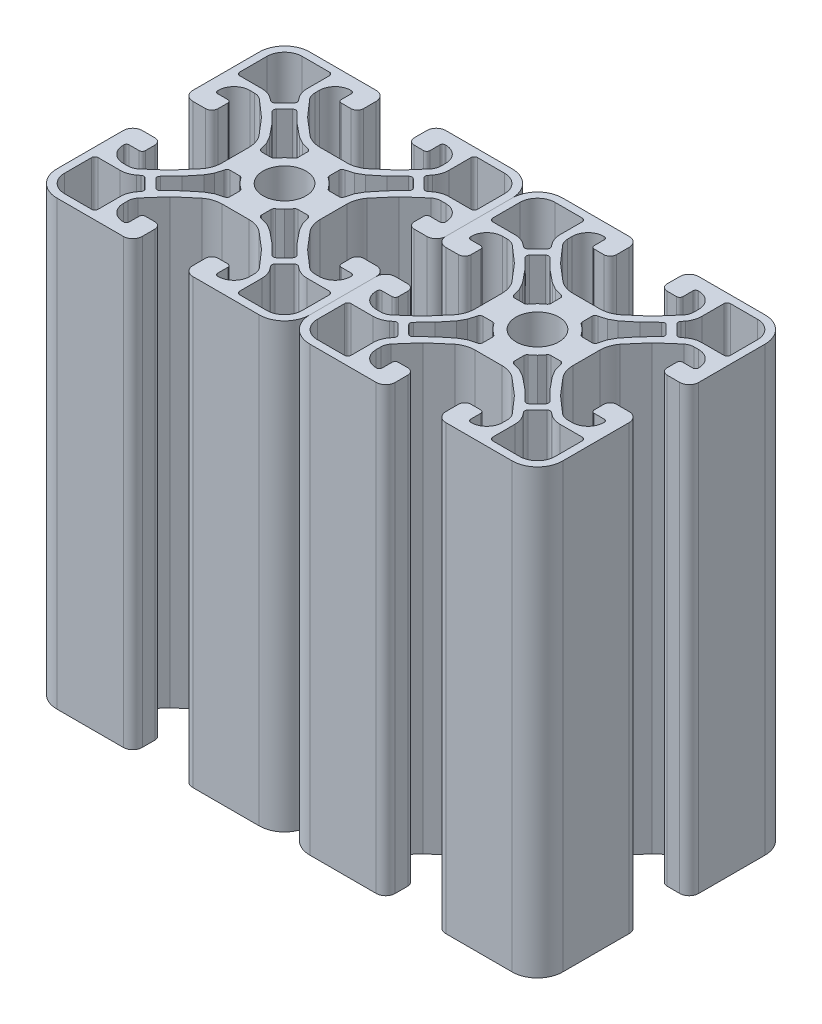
from build123d import *

# Parameters (mm, degrees)
MODEL_R                          = 3.4
PROFILE_10396_PRO4040E_1_DEPTH   = 70
MODEL_ON_SEGMENT_2_R             = 3.4
PROFILE_10396_PRO4040E_1_2_DEPTH = 70


with BuildPart() as part:
    # Model → Profile 10396_PRO4040E_1 (new body)
    with BuildSketch(Plane(origin=(-20, 35, 0), x_dir=(1, 0, 0), z_dir=(0, -1, 0))):
        with BuildLine():
            Line((14.783583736, 10), (15.5, 10))
            ThreePointArc((15.5, 10), (17.267766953, 9.267766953), (18, 7.5))
            Line((18, 7.5), (18, 7.41))
            ThreePointArc((18, 7.41), (17.87991378, 7.12008622), (17.59, 7))
            Line((17.59, 7), (16, 7))
            ThreePointArc((16, 7), (15.646446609, 6.853553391), (15.5, 6.5))
            Line((15.5, 6.5), (15.5, 5))
            ThreePointArc((15.5, 5), (15.792893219, 4.292893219), (16.5, 4))
            Line((16.5, 4), (18.5, 4))
            ThreePointArc((18.5, 4), (19.560660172, 4.439339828), (20, 5.5))
            Line((20, 5.5), (20, 16))
            ThreePointArc((20, 16), (18.828427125, 18.828427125), (16, 20))
            Line((16, 20), (5.5, 20))
            ThreePointArc((5.5, 20), (4.439339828, 19.560660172), (4, 18.5))
            Line((4, 18.5), (4, 16.5))
            ThreePointArc((4, 16.5), (4.292893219, 15.792893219), (5, 15.5))
            Line((5, 15.5), (6.5, 15.5))
            ThreePointArc((6.5, 15.5), (6.853553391, 15.646446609), (7, 16))
            Line((7, 16), (7, 17.59))
            ThreePointArc((7, 17.59), (7.12008622, 17.87991378), (7.41, 18))
            Line((7.41, 18), (7.5, 18))
            ThreePointArc((7.5, 18), (9.267766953, 17.267766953), (10, 15.5))
            Line((10, 15.5), (10, 14.783583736))
            ThreePointArc((10, 14.783583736), (9.896220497, 14.147700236), (9.595652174, 13.577808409))
            Line((9.595652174, 13.577808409), (7.22489987, 10.870154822))
            Line((7.22489987, 10.870154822), (4.489943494, 8.530952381))
            ThreePointArc((4.489943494, 8.530952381), (3.365314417, 7.950250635), (2.115552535, 7.75))
            Line((2.115552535, 7.75), (-2.115552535, 7.75))
            ThreePointArc((-2.115552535, 7.75), (-3.365314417, 7.950250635), (-4.489943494, 8.530952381))
            Line((-4.489943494, 8.530952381), (-7.22489987, 10.870154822))
            Line((-7.22489987, 10.870154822), (-9.595652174, 13.577808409))
            ThreePointArc((-9.595652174, 13.577808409), (-9.896220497, 14.147700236), (-10, 14.783583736))
            Line((-10, 14.783583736), (-10, 15.5))
            ThreePointArc((-10, 15.5), (-9.267766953, 17.267766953), (-7.5, 18))
            Line((-7.5, 18), (-7.41, 18))
            ThreePointArc((-7.41, 18), (-7.12008622, 17.87991378), (-7, 17.59))
            Line((-7, 17.59), (-7, 16))
            ThreePointArc((-7, 16), (-6.853553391, 15.646446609), (-6.5, 15.5))
            Line((-6.5, 15.5), (-5, 15.5))
            ThreePointArc((-5, 15.5), (-4.292893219, 15.792893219), (-4, 16.5))
            Line((-4, 16.5), (-4, 18.5))
            ThreePointArc((-4, 18.5), (-4.439339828, 19.560660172), (-5.5, 20))
            Line((-5.5, 20), (-16, 20))
            ThreePointArc((-16, 20), (-18.828427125, 18.828427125), (-20, 16))
            Line((-20, 16), (-20, 5.5))
            ThreePointArc((-20, 5.5), (-19.560660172, 4.439339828), (-18.5, 4))
            Line((-18.5, 4), (-16.5, 4))
            ThreePointArc((-16.5, 4), (-15.792893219, 4.292893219), (-15.5, 5))
            Line((-15.5, 5), (-15.5, 6.5))
            ThreePointArc((-15.5, 6.5), (-15.646446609, 6.853553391), (-16, 7))
            Line((-16, 7), (-17.59, 7))
            ThreePointArc((-17.59, 7), (-17.87991378, 7.12008622), (-18, 7.41))
            Line((-18, 7.41), (-18, 7.5))
            ThreePointArc((-18, 7.5), (-17.267766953, 9.267766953), (-15.5, 10))
            Line((-15.5, 10), (-14.783583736, 10))
            ThreePointArc((-14.783583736, 10), (-14.147700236, 9.896220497), (-13.577808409, 9.595652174))
            Line((-13.577808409, 9.595652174), (-10.870154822, 7.22489987))
            Line((-10.870154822, 7.22489987), (-8.530952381, 4.489943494))
            ThreePointArc((-8.530952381, 4.489943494), (-7.950250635, 3.365314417), (-7.75, 2.115552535))
            Line((-7.75, 2.115552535), (-7.75, -2.115552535))
            ThreePointArc((-7.75, -2.115552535), (-7.950250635, -3.365314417), (-8.530952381, -4.489943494))
            Line((-8.530952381, -4.489943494), (-10.870154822, -7.22489987))
            Line((-10.870154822, -7.22489987), (-13.577808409, -9.595652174))
            ThreePointArc((-13.577808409, -9.595652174), (-14.147700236, -9.896220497), (-14.783583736, -10))
            Line((-14.783583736, -10), (-15.5, -10))
            ThreePointArc((-15.5, -10), (-17.267766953, -9.267766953), (-18, -7.5))
            Line((-18, -7.5), (-18, -7.41))
            ThreePointArc((-18, -7.41), (-17.87991378, -7.12008622), (-17.59, -7))
            Line((-17.59, -7), (-16, -7))
            ThreePointArc((-16, -7), (-15.646446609, -6.853553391), (-15.5, -6.5))
            Line((-15.5, -6.5), (-15.5, -5))
            ThreePointArc((-15.5, -5), (-15.792893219, -4.292893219), (-16.5, -4))
            Line((-16.5, -4), (-18.5, -4))
            ThreePointArc((-18.5, -4), (-19.560660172, -4.439339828), (-20, -5.5))
            Line((-20, -5.5), (-20, -16))
            ThreePointArc((-20, -16), (-18.828427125, -18.828427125), (-16, -20))
            Line((-16, -20), (-5.5, -20))
            ThreePointArc((-5.5, -20), (-4.439339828, -19.560660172), (-4, -18.5))
            Line((-4, -18.5), (-4, -16.5))
            ThreePointArc((-4, -16.5), (-4.292893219, -15.792893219), (-5, -15.5))
            Line((-5, -15.5), (-6.5, -15.5))
            ThreePointArc((-6.5, -15.5), (-6.853553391, -15.646446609), (-7, -16))
            Line((-7, -16), (-7, -17.59))
            ThreePointArc((-7, -17.59), (-7.12008622, -17.87991378), (-7.41, -18))
            Line((-7.41, -18), (-7.5, -18))
            ThreePointArc((-7.5, -18), (-9.267766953, -17.267766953), (-10, -15.5))
            Line((-10, -15.5), (-10, -14.783583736))
            ThreePointArc((-10, -14.783583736), (-9.896220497, -14.147700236), (-9.595652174, -13.577808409))
            Line((-9.595652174, -13.577808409), (-7.22489987, -10.870154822))
            Line((-7.22489987, -10.870154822), (-4.489943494, -8.530952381))
            ThreePointArc((-4.489943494, -8.530952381), (-3.365314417, -7.950250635), (-2.115552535, -7.75))
            Line((-2.115552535, -7.75), (2.115552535, -7.75))
            ThreePointArc((2.115552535, -7.75), (3.365314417, -7.950250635), (4.489943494, -8.530952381))
            Line((4.489943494, -8.530952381), (7.22489987, -10.870154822))
            Line((7.22489987, -10.870154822), (9.595652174, -13.577808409))
            ThreePointArc((9.595652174, -13.577808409), (9.896220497, -14.147700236), (10, -14.783583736))
            Line((10, -14.783583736), (10, -15.5))
            ThreePointArc((10, -15.5), (9.267766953, -17.267766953), (7.5, -18))
            Line((7.5, -18), (7.41, -18))
            ThreePointArc((7.41, -18), (7.12008622, -17.87991378), (7, -17.59))
            Line((7, -17.59), (7, -16))
            ThreePointArc((7, -16), (6.853553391, -15.646446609), (6.5, -15.5))
            Line((6.5, -15.5), (5, -15.5))
            ThreePointArc((5, -15.5), (4.292893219, -15.792893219), (4, -16.5))
            Line((4, -16.5), (4, -18.5))
            ThreePointArc((4, -18.5), (4.439339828, -19.560660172), (5.5, -20))
            Line((5.5, -20), (16, -20))
            ThreePointArc((16, -20), (18.828427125, -18.828427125), (20, -16))
            Line((20, -16), (20, -5.5))
            ThreePointArc((20, -5.5), (19.560660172, -4.439339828), (18.5, -4))
            Line((18.5, -4), (16.5, -4))
            ThreePointArc((16.5, -4), (15.792893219, -4.292893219), (15.5, -5))
            Line((15.5, -5), (15.5, -6.5))
            ThreePointArc((15.5, -6.5), (15.646446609, -6.853553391), (16, -7))
            Line((16, -7), (17.59, -7))
            ThreePointArc((17.59, -7), (17.87991378, -7.12008622), (18, -7.41))
            Line((18, -7.41), (18, -7.5))
            ThreePointArc((18, -7.5), (17.267766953, -9.267766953), (15.5, -10))
            Line((15.5, -10), (14.783583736, -10))
            ThreePointArc((14.783583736, -10), (14.147700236, -9.896220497), (13.577808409, -9.595652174))
            Line((13.577808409, -9.595652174), (10.870154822, -7.22489987))
            Line((10.870154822, -7.22489987), (8.530952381, -4.489943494))
            ThreePointArc((8.530952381, -4.489943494), (7.950250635, -3.365314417), (7.75, -2.115552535))
            Line((7.75, -2.115552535), (7.75, 2.115552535))
            ThreePointArc((7.75, 2.115552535), (7.950250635, 3.365314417), (8.530952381, 4.489943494))
            Line((8.530952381, 4.489943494), (10.870154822, 7.22489987))
            Line((10.870154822, 7.22489987), (13.577808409, 9.595652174))
            ThreePointArc((13.577808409, 9.595652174), (14.147700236, 9.896220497), (14.783583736, 10))
        make_face()
        Circle(MODEL_R, mode=Mode.SUBTRACT)
        with BuildLine():
            Line((6.119036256, 2.5), (4.609772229, 2.5))
            ThreePointArc((4.609772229, 2.5), (4.371406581, 2.560475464), (4.190702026, 2.727272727))
            Line((4.190702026, 2.727272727), (3.535533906, 3.535533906))
            Line((3.535533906, 3.535533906), (2.727272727, 4.190702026))
            ThreePointArc((2.727272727, 4.190702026), (2.560475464, 4.371406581), (2.5, 4.609772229))
            Line((2.5, 4.609772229), (2.5, 6.119036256))
            ThreePointArc((2.5, 6.119036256), (2.620005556, 6.444004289), (2.922416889, 6.612980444))
            Line((2.922416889, 6.612980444), (4.119717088, 6.951737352))
            Line((4.119717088, 6.951737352), (5.202260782, 7.565238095))
            Line((5.202260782, 7.565238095), (7.09151636, 9.099206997))
            Line((7.09151636, 9.099206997), (8.830293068, 10.801852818))
            ThreePointArc((8.830293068, 10.801852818), (9.187339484, 10.961158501), (9.549882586, 10.814792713))
            Line((9.549882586, 10.814792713), (10.814792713, 9.549882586))
            ThreePointArc((10.814792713, 9.549882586), (10.961158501, 9.187339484), (10.801852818, 8.830293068))
            Line((10.801852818, 8.830293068), (9.099206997, 7.09151636))
            Line((9.099206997, 7.09151636), (7.565238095, 5.202260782))
            Line((7.565238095, 5.202260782), (6.951737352, 4.119717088))
            Line((6.951737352, 4.119717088), (6.612980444, 2.922416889))
            ThreePointArc((6.612980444, 2.922416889), (6.444004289, 2.620005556), (6.119036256, 2.5))
        make_face(mode=Mode.SUBTRACT)
        with BuildLine():
            Line((18.8, 16), (18.8, 11.7))
            ThreePointArc((18.8, 11.7), (18.653553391, 11.346446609), (18.3, 11.2))
            Line((18.3, 11.2), (14.783583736, 11.2))
            ThreePointArc((14.783583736, 11.2), (13.766170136, 11.033952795), (12.854343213, 10.553043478))
            Line((12.854343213, 10.553043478), (12.446581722, 10.238570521))
            ThreePointArc((12.446581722, 10.238570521), (12.10771655, 10.132361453), (11.783802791, 10.277928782))
            Line((11.783802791, 10.277928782), (10.277928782, 11.783802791))
            ThreePointArc((10.277928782, 11.783802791), (10.132361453, 12.10771655), (10.238570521, 12.446581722))
            Line((10.238570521, 12.446581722), (10.553043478, 12.854343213))
            ThreePointArc((10.553043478, 12.854343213), (11.033952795, 13.766170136), (11.2, 14.783583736))
            Line((11.2, 14.783583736), (11.2, 18.3))
            ThreePointArc((11.2, 18.3), (11.346446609, 18.653553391), (11.7, 18.8))
            Line((11.7, 18.8), (16, 18.8))
            ThreePointArc((16, 18.8), (17.979898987, 17.979898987), (18.8, 16))
        make_face(mode=Mode.SUBTRACT)
        with BuildLine():
            Line((-2.5, 6.119036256), (-2.5, 4.609772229))
            ThreePointArc((-2.5, 4.609772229), (-2.560475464, 4.371406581), (-2.727272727, 4.190702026))
            Line((-2.727272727, 4.190702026), (-3.535533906, 3.535533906))
            Line((-3.535533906, 3.535533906), (-4.190702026, 2.727272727))
            ThreePointArc((-4.190702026, 2.727272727), (-4.371406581, 2.560475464), (-4.609772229, 2.5))
            Line((-4.609772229, 2.5), (-6.119036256, 2.5))
            ThreePointArc((-6.119036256, 2.5), (-6.444004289, 2.620005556), (-6.612980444, 2.922416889))
            Line((-6.612980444, 2.922416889), (-6.951737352, 4.119717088))
            Line((-6.951737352, 4.119717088), (-7.565238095, 5.202260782))
            Line((-7.565238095, 5.202260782), (-9.099206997, 7.09151636))
            Line((-9.099206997, 7.09151636), (-10.801852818, 8.830293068))
            ThreePointArc((-10.801852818, 8.830293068), (-10.961158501, 9.187339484), (-10.814792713, 9.549882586))
            Line((-10.814792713, 9.549882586), (-9.549882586, 10.814792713))
            ThreePointArc((-9.549882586, 10.814792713), (-9.187339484, 10.961158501), (-8.830293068, 10.801852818))
            Line((-8.830293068, 10.801852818), (-7.09151636, 9.099206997))
            Line((-7.09151636, 9.099206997), (-5.202260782, 7.565238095))
            Line((-5.202260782, 7.565238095), (-4.119717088, 6.951737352))
            Line((-4.119717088, 6.951737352), (-2.922416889, 6.612980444))
            ThreePointArc((-2.922416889, 6.612980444), (-2.620005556, 6.444004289), (-2.5, 6.119036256))
        make_face(mode=Mode.SUBTRACT)
        with BuildLine():
            Line((-16, 18.8), (-11.7, 18.8))
            ThreePointArc((-11.7, 18.8), (-11.346446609, 18.653553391), (-11.2, 18.3))
            Line((-11.2, 18.3), (-11.2, 14.783583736))
            ThreePointArc((-11.2, 14.783583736), (-11.033952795, 13.766170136), (-10.553043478, 12.854343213))
            Line((-10.553043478, 12.854343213), (-10.238570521, 12.446581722))
            ThreePointArc((-10.238570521, 12.446581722), (-10.132361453, 12.10771655), (-10.277928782, 11.783802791))
            Line((-10.277928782, 11.783802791), (-11.783802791, 10.277928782))
            ThreePointArc((-11.783802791, 10.277928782), (-12.10771655, 10.132361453), (-12.446581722, 10.238570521))
            Line((-12.446581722, 10.238570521), (-12.854343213, 10.553043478))
            ThreePointArc((-12.854343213, 10.553043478), (-13.766170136, 11.033952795), (-14.783583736, 11.2))
            Line((-14.783583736, 11.2), (-18.3, 11.2))
            ThreePointArc((-18.3, 11.2), (-18.653553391, 11.346446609), (-18.8, 11.7))
            Line((-18.8, 11.7), (-18.8, 16))
            ThreePointArc((-18.8, 16), (-17.979898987, 17.979898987), (-16, 18.8))
        make_face(mode=Mode.SUBTRACT)
        with BuildLine():
            Line((2.5, -6.119036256), (2.5, -4.609772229))
            ThreePointArc((2.5, -4.609772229), (2.560475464, -4.371406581), (2.727272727, -4.190702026))
            Line((2.727272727, -4.190702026), (3.535533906, -3.535533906))
            Line((3.535533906, -3.535533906), (4.190702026, -2.727272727))
            ThreePointArc((4.190702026, -2.727272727), (4.371406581, -2.560475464), (4.609772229, -2.5))
            Line((4.609772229, -2.5), (6.119036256, -2.5))
            ThreePointArc((6.119036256, -2.5), (6.444004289, -2.620005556), (6.612980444, -2.922416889))
            Line((6.612980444, -2.922416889), (6.951737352, -4.119717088))
            Line((6.951737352, -4.119717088), (7.565238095, -5.202260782))
            Line((7.565238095, -5.202260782), (9.099206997, -7.09151636))
            Line((9.099206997, -7.09151636), (10.801852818, -8.830293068))
            ThreePointArc((10.801852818, -8.830293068), (10.961158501, -9.187339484), (10.814792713, -9.549882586))
            Line((10.814792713, -9.549882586), (9.549882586, -10.814792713))
            ThreePointArc((9.549882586, -10.814792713), (9.187339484, -10.961158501), (8.830293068, -10.801852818))
            Line((8.830293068, -10.801852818), (7.09151636, -9.099206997))
            Line((7.09151636, -9.099206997), (5.202260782, -7.565238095))
            Line((5.202260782, -7.565238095), (4.119717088, -6.951737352))
            Line((4.119717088, -6.951737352), (2.922416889, -6.612980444))
            ThreePointArc((2.922416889, -6.612980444), (2.620005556, -6.444004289), (2.5, -6.119036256))
        make_face(mode=Mode.SUBTRACT)
        with BuildLine():
            Line((16, -18.8), (11.7, -18.8))
            ThreePointArc((11.7, -18.8), (11.346446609, -18.653553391), (11.2, -18.3))
            Line((11.2, -18.3), (11.2, -14.783583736))
            ThreePointArc((11.2, -14.783583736), (11.033952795, -13.766170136), (10.553043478, -12.854343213))
            Line((10.553043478, -12.854343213), (10.238570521, -12.446581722))
            ThreePointArc((10.238570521, -12.446581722), (10.132361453, -12.10771655), (10.277928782, -11.783802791))
            Line((10.277928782, -11.783802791), (11.783802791, -10.277928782))
            ThreePointArc((11.783802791, -10.277928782), (12.10771655, -10.132361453), (12.446581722, -10.238570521))
            Line((12.446581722, -10.238570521), (12.854343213, -10.553043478))
            ThreePointArc((12.854343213, -10.553043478), (13.766170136, -11.033952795), (14.783583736, -11.2))
            Line((14.783583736, -11.2), (18.3, -11.2))
            ThreePointArc((18.3, -11.2), (18.653553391, -11.346446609), (18.8, -11.7))
            Line((18.8, -11.7), (18.8, -16))
            ThreePointArc((18.8, -16), (17.979898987, -17.979898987), (16, -18.8))
        make_face(mode=Mode.SUBTRACT)
        with BuildLine():
            Line((-6.119036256, -2.5), (-4.609772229, -2.5))
            ThreePointArc((-4.609772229, -2.5), (-4.371406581, -2.560475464), (-4.190702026, -2.727272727))
            Line((-4.190702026, -2.727272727), (-3.535533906, -3.535533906))
            Line((-3.535533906, -3.535533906), (-2.727272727, -4.190702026))
            ThreePointArc((-2.727272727, -4.190702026), (-2.560475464, -4.371406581), (-2.5, -4.609772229))
            Line((-2.5, -4.609772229), (-2.5, -6.119036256))
            ThreePointArc((-2.5, -6.119036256), (-2.620005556, -6.444004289), (-2.922416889, -6.612980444))
            Line((-2.922416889, -6.612980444), (-4.119717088, -6.951737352))
            Line((-4.119717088, -6.951737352), (-5.202260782, -7.565238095))
            Line((-5.202260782, -7.565238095), (-7.09151636, -9.099206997))
            Line((-7.09151636, -9.099206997), (-8.830293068, -10.801852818))
            ThreePointArc((-8.830293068, -10.801852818), (-9.187339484, -10.961158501), (-9.549882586, -10.814792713))
            Line((-9.549882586, -10.814792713), (-10.814792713, -9.549882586))
            ThreePointArc((-10.814792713, -9.549882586), (-10.961158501, -9.187339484), (-10.801852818, -8.830293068))
            Line((-10.801852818, -8.830293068), (-9.099206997, -7.09151636))
            Line((-9.099206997, -7.09151636), (-7.565238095, -5.202260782))
            Line((-7.565238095, -5.202260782), (-6.951737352, -4.119717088))
            Line((-6.951737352, -4.119717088), (-6.612980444, -2.922416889))
            ThreePointArc((-6.612980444, -2.922416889), (-6.444004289, -2.620005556), (-6.119036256, -2.5))
        make_face(mode=Mode.SUBTRACT)
        with BuildLine():
            Line((-18.8, -16), (-18.8, -11.7))
            ThreePointArc((-18.8, -11.7), (-18.653553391, -11.346446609), (-18.3, -11.2))
            Line((-18.3, -11.2), (-14.783583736, -11.2))
            ThreePointArc((-14.783583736, -11.2), (-13.766170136, -11.033952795), (-12.854343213, -10.553043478))
            Line((-12.854343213, -10.553043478), (-12.446581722, -10.238570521))
            ThreePointArc((-12.446581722, -10.238570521), (-12.10771655, -10.132361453), (-11.783802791, -10.277928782))
            Line((-11.783802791, -10.277928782), (-10.277928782, -11.783802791))
            ThreePointArc((-10.277928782, -11.783802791), (-10.132361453, -12.10771655), (-10.238570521, -12.446581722))
            Line((-10.238570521, -12.446581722), (-10.553043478, -12.854343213))
            ThreePointArc((-10.553043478, -12.854343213), (-11.033952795, -13.766170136), (-11.2, -14.783583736))
            Line((-11.2, -14.783583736), (-11.2, -18.3))
            ThreePointArc((-11.2, -18.3), (-11.346446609, -18.653553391), (-11.7, -18.8))
            Line((-11.7, -18.8), (-16, -18.8))
            ThreePointArc((-16, -18.8), (-17.979898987, -17.979898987), (-18.8, -16))
        make_face(mode=Mode.SUBTRACT)
    extrude(amount=PROFILE_10396_PRO4040E_1_DEPTH)


with BuildPart() as body_2:
    # Model on segment 2 (on carried to segment 2) → Profile 10396_PRO4040E_1 2 (new body)
    with BuildSketch(Plane(origin=(20, 35, 0), x_dir=(1, 0, 0), z_dir=(0, -1, 0))):
        with BuildLine():
            Line((14.783583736, 10), (15.5, 10))
            ThreePointArc((15.5, 10), (17.267766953, 9.267766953), (18, 7.5))
            Line((18, 7.5), (18, 7.41))
            ThreePointArc((18, 7.41), (17.87991378, 7.12008622), (17.59, 7))
            Line((17.59, 7), (16, 7))
            ThreePointArc((16, 7), (15.646446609, 6.853553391), (15.5, 6.5))
            Line((15.5, 6.5), (15.5, 5))
            ThreePointArc((15.5, 5), (15.792893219, 4.292893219), (16.5, 4))
            Line((16.5, 4), (18.5, 4))
            ThreePointArc((18.5, 4), (19.560660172, 4.439339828), (20, 5.5))
            Line((20, 5.5), (20, 16))
            ThreePointArc((20, 16), (18.828427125, 18.828427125), (16, 20))
            Line((16, 20), (5.5, 20))
            ThreePointArc((5.5, 20), (4.439339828, 19.560660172), (4, 18.5))
            Line((4, 18.5), (4, 16.5))
            ThreePointArc((4, 16.5), (4.292893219, 15.792893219), (5, 15.5))
            Line((5, 15.5), (6.5, 15.5))
            ThreePointArc((6.5, 15.5), (6.853553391, 15.646446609), (7, 16))
            Line((7, 16), (7, 17.59))
            ThreePointArc((7, 17.59), (7.12008622, 17.87991378), (7.41, 18))
            Line((7.41, 18), (7.5, 18))
            ThreePointArc((7.5, 18), (9.267766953, 17.267766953), (10, 15.5))
            Line((10, 15.5), (10, 14.783583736))
            ThreePointArc((10, 14.783583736), (9.896220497, 14.147700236), (9.595652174, 13.577808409))
            Line((9.595652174, 13.577808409), (7.22489987, 10.870154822))
            Line((7.22489987, 10.870154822), (4.489943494, 8.530952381))
            ThreePointArc((4.489943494, 8.530952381), (3.365314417, 7.950250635), (2.115552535, 7.75))
            Line((2.115552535, 7.75), (-2.115552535, 7.75))
            ThreePointArc((-2.115552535, 7.75), (-3.365314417, 7.950250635), (-4.489943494, 8.530952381))
            Line((-4.489943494, 8.530952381), (-7.22489987, 10.870154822))
            Line((-7.22489987, 10.870154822), (-9.595652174, 13.577808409))
            ThreePointArc((-9.595652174, 13.577808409), (-9.896220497, 14.147700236), (-10, 14.783583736))
            Line((-10, 14.783583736), (-10, 15.5))
            ThreePointArc((-10, 15.5), (-9.267766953, 17.267766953), (-7.5, 18))
            Line((-7.5, 18), (-7.41, 18))
            ThreePointArc((-7.41, 18), (-7.12008622, 17.87991378), (-7, 17.59))
            Line((-7, 17.59), (-7, 16))
            ThreePointArc((-7, 16), (-6.853553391, 15.646446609), (-6.5, 15.5))
            Line((-6.5, 15.5), (-5, 15.5))
            ThreePointArc((-5, 15.5), (-4.292893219, 15.792893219), (-4, 16.5))
            Line((-4, 16.5), (-4, 18.5))
            ThreePointArc((-4, 18.5), (-4.439339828, 19.560660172), (-5.5, 20))
            Line((-5.5, 20), (-16, 20))
            ThreePointArc((-16, 20), (-18.828427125, 18.828427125), (-20, 16))
            Line((-20, 16), (-20, 5.5))
            ThreePointArc((-20, 5.5), (-19.560660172, 4.439339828), (-18.5, 4))
            Line((-18.5, 4), (-16.5, 4))
            ThreePointArc((-16.5, 4), (-15.792893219, 4.292893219), (-15.5, 5))
            Line((-15.5, 5), (-15.5, 6.5))
            ThreePointArc((-15.5, 6.5), (-15.646446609, 6.853553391), (-16, 7))
            Line((-16, 7), (-17.59, 7))
            ThreePointArc((-17.59, 7), (-17.87991378, 7.12008622), (-18, 7.41))
            Line((-18, 7.41), (-18, 7.5))
            ThreePointArc((-18, 7.5), (-17.267766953, 9.267766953), (-15.5, 10))
            Line((-15.5, 10), (-14.783583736, 10))
            ThreePointArc((-14.783583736, 10), (-14.147700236, 9.896220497), (-13.577808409, 9.595652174))
            Line((-13.577808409, 9.595652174), (-10.870154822, 7.22489987))
            Line((-10.870154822, 7.22489987), (-8.530952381, 4.489943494))
            ThreePointArc((-8.530952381, 4.489943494), (-7.950250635, 3.365314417), (-7.75, 2.115552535))
            Line((-7.75, 2.115552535), (-7.75, -2.115552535))
            ThreePointArc((-7.75, -2.115552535), (-7.950250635, -3.365314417), (-8.530952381, -4.489943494))
            Line((-8.530952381, -4.489943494), (-10.870154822, -7.22489987))
            Line((-10.870154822, -7.22489987), (-13.577808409, -9.595652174))
            ThreePointArc((-13.577808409, -9.595652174), (-14.147700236, -9.896220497), (-14.783583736, -10))
            Line((-14.783583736, -10), (-15.5, -10))
            ThreePointArc((-15.5, -10), (-17.267766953, -9.267766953), (-18, -7.5))
            Line((-18, -7.5), (-18, -7.41))
            ThreePointArc((-18, -7.41), (-17.87991378, -7.12008622), (-17.59, -7))
            Line((-17.59, -7), (-16, -7))
            ThreePointArc((-16, -7), (-15.646446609, -6.853553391), (-15.5, -6.5))
            Line((-15.5, -6.5), (-15.5, -5))
            ThreePointArc((-15.5, -5), (-15.792893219, -4.292893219), (-16.5, -4))
            Line((-16.5, -4), (-18.5, -4))
            ThreePointArc((-18.5, -4), (-19.560660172, -4.439339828), (-20, -5.5))
            Line((-20, -5.5), (-20, -16))
            ThreePointArc((-20, -16), (-18.828427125, -18.828427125), (-16, -20))
            Line((-16, -20), (-5.5, -20))
            ThreePointArc((-5.5, -20), (-4.439339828, -19.560660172), (-4, -18.5))
            Line((-4, -18.5), (-4, -16.5))
            ThreePointArc((-4, -16.5), (-4.292893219, -15.792893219), (-5, -15.5))
            Line((-5, -15.5), (-6.5, -15.5))
            ThreePointArc((-6.5, -15.5), (-6.853553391, -15.646446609), (-7, -16))
            Line((-7, -16), (-7, -17.59))
            ThreePointArc((-7, -17.59), (-7.12008622, -17.87991378), (-7.41, -18))
            Line((-7.41, -18), (-7.5, -18))
            ThreePointArc((-7.5, -18), (-9.267766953, -17.267766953), (-10, -15.5))
            Line((-10, -15.5), (-10, -14.783583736))
            ThreePointArc((-10, -14.783583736), (-9.896220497, -14.147700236), (-9.595652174, -13.577808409))
            Line((-9.595652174, -13.577808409), (-7.22489987, -10.870154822))
            Line((-7.22489987, -10.870154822), (-4.489943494, -8.530952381))
            ThreePointArc((-4.489943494, -8.530952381), (-3.365314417, -7.950250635), (-2.115552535, -7.75))
            Line((-2.115552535, -7.75), (2.115552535, -7.75))
            ThreePointArc((2.115552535, -7.75), (3.365314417, -7.950250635), (4.489943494, -8.530952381))
            Line((4.489943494, -8.530952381), (7.22489987, -10.870154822))
            Line((7.22489987, -10.870154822), (9.595652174, -13.577808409))
            ThreePointArc((9.595652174, -13.577808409), (9.896220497, -14.147700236), (10, -14.783583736))
            Line((10, -14.783583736), (10, -15.5))
            ThreePointArc((10, -15.5), (9.267766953, -17.267766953), (7.5, -18))
            Line((7.5, -18), (7.41, -18))
            ThreePointArc((7.41, -18), (7.12008622, -17.87991378), (7, -17.59))
            Line((7, -17.59), (7, -16))
            ThreePointArc((7, -16), (6.853553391, -15.646446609), (6.5, -15.5))
            Line((6.5, -15.5), (5, -15.5))
            ThreePointArc((5, -15.5), (4.292893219, -15.792893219), (4, -16.5))
            Line((4, -16.5), (4, -18.5))
            ThreePointArc((4, -18.5), (4.439339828, -19.560660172), (5.5, -20))
            Line((5.5, -20), (16, -20))
            ThreePointArc((16, -20), (18.828427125, -18.828427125), (20, -16))
            Line((20, -16), (20, -5.5))
            ThreePointArc((20, -5.5), (19.560660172, -4.439339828), (18.5, -4))
            Line((18.5, -4), (16.5, -4))
            ThreePointArc((16.5, -4), (15.792893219, -4.292893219), (15.5, -5))
            Line((15.5, -5), (15.5, -6.5))
            ThreePointArc((15.5, -6.5), (15.646446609, -6.853553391), (16, -7))
            Line((16, -7), (17.59, -7))
            ThreePointArc((17.59, -7), (17.87991378, -7.12008622), (18, -7.41))
            Line((18, -7.41), (18, -7.5))
            ThreePointArc((18, -7.5), (17.267766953, -9.267766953), (15.5, -10))
            Line((15.5, -10), (14.783583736, -10))
            ThreePointArc((14.783583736, -10), (14.147700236, -9.896220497), (13.577808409, -9.595652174))
            Line((13.577808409, -9.595652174), (10.870154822, -7.22489987))
            Line((10.870154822, -7.22489987), (8.530952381, -4.489943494))
            ThreePointArc((8.530952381, -4.489943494), (7.950250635, -3.365314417), (7.75, -2.115552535))
            Line((7.75, -2.115552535), (7.75, 2.115552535))
            ThreePointArc((7.75, 2.115552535), (7.950250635, 3.365314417), (8.530952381, 4.489943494))
            Line((8.530952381, 4.489943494), (10.870154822, 7.22489987))
            Line((10.870154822, 7.22489987), (13.577808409, 9.595652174))
            ThreePointArc((13.577808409, 9.595652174), (14.147700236, 9.896220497), (14.783583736, 10))
        make_face()
        Circle(MODEL_ON_SEGMENT_2_R, mode=Mode.SUBTRACT)
        with BuildLine():
            Line((6.119036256, 2.5), (4.609772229, 2.5))
            ThreePointArc((4.609772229, 2.5), (4.371406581, 2.560475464), (4.190702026, 2.727272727))
            Line((4.190702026, 2.727272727), (3.535533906, 3.535533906))
            Line((3.535533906, 3.535533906), (2.727272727, 4.190702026))
            ThreePointArc((2.727272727, 4.190702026), (2.560475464, 4.371406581), (2.5, 4.609772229))
            Line((2.5, 4.609772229), (2.5, 6.119036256))
            ThreePointArc((2.5, 6.119036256), (2.620005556, 6.444004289), (2.922416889, 6.612980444))
            Line((2.922416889, 6.612980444), (4.119717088, 6.951737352))
            Line((4.119717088, 6.951737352), (5.202260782, 7.565238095))
            Line((5.202260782, 7.565238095), (7.09151636, 9.099206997))
            Line((7.09151636, 9.099206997), (8.830293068, 10.801852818))
            ThreePointArc((8.830293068, 10.801852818), (9.187339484, 10.961158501), (9.549882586, 10.814792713))
            Line((9.549882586, 10.814792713), (10.814792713, 9.549882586))
            ThreePointArc((10.814792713, 9.549882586), (10.961158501, 9.187339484), (10.801852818, 8.830293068))
            Line((10.801852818, 8.830293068), (9.099206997, 7.09151636))
            Line((9.099206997, 7.09151636), (7.565238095, 5.202260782))
            Line((7.565238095, 5.202260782), (6.951737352, 4.119717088))
            Line((6.951737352, 4.119717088), (6.612980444, 2.922416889))
            ThreePointArc((6.612980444, 2.922416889), (6.444004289, 2.620005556), (6.119036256, 2.5))
        make_face(mode=Mode.SUBTRACT)
        with BuildLine():
            Line((18.8, 16), (18.8, 11.7))
            ThreePointArc((18.8, 11.7), (18.653553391, 11.346446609), (18.3, 11.2))
            Line((18.3, 11.2), (14.783583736, 11.2))
            ThreePointArc((14.783583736, 11.2), (13.766170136, 11.033952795), (12.854343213, 10.553043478))
            Line((12.854343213, 10.553043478), (12.446581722, 10.238570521))
            ThreePointArc((12.446581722, 10.238570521), (12.10771655, 10.132361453), (11.783802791, 10.277928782))
            Line((11.783802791, 10.277928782), (10.277928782, 11.783802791))
            ThreePointArc((10.277928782, 11.783802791), (10.132361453, 12.10771655), (10.238570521, 12.446581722))
            Line((10.238570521, 12.446581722), (10.553043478, 12.854343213))
            ThreePointArc((10.553043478, 12.854343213), (11.033952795, 13.766170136), (11.2, 14.783583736))
            Line((11.2, 14.783583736), (11.2, 18.3))
            ThreePointArc((11.2, 18.3), (11.346446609, 18.653553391), (11.7, 18.8))
            Line((11.7, 18.8), (16, 18.8))
            ThreePointArc((16, 18.8), (17.979898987, 17.979898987), (18.8, 16))
        make_face(mode=Mode.SUBTRACT)
        with BuildLine():
            Line((-2.5, 6.119036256), (-2.5, 4.609772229))
            ThreePointArc((-2.5, 4.609772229), (-2.560475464, 4.371406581), (-2.727272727, 4.190702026))
            Line((-2.727272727, 4.190702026), (-3.535533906, 3.535533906))
            Line((-3.535533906, 3.535533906), (-4.190702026, 2.727272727))
            ThreePointArc((-4.190702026, 2.727272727), (-4.371406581, 2.560475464), (-4.609772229, 2.5))
            Line((-4.609772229, 2.5), (-6.119036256, 2.5))
            ThreePointArc((-6.119036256, 2.5), (-6.444004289, 2.620005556), (-6.612980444, 2.922416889))
            Line((-6.612980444, 2.922416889), (-6.951737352, 4.119717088))
            Line((-6.951737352, 4.119717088), (-7.565238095, 5.202260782))
            Line((-7.565238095, 5.202260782), (-9.099206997, 7.09151636))
            Line((-9.099206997, 7.09151636), (-10.801852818, 8.830293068))
            ThreePointArc((-10.801852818, 8.830293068), (-10.961158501, 9.187339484), (-10.814792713, 9.549882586))
            Line((-10.814792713, 9.549882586), (-9.549882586, 10.814792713))
            ThreePointArc((-9.549882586, 10.814792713), (-9.187339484, 10.961158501), (-8.830293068, 10.801852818))
            Line((-8.830293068, 10.801852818), (-7.09151636, 9.099206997))
            Line((-7.09151636, 9.099206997), (-5.202260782, 7.565238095))
            Line((-5.202260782, 7.565238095), (-4.119717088, 6.951737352))
            Line((-4.119717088, 6.951737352), (-2.922416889, 6.612980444))
            ThreePointArc((-2.922416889, 6.612980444), (-2.620005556, 6.444004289), (-2.5, 6.119036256))
        make_face(mode=Mode.SUBTRACT)
        with BuildLine():
            Line((-16, 18.8), (-11.7, 18.8))
            ThreePointArc((-11.7, 18.8), (-11.346446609, 18.653553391), (-11.2, 18.3))
            Line((-11.2, 18.3), (-11.2, 14.783583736))
            ThreePointArc((-11.2, 14.783583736), (-11.033952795, 13.766170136), (-10.553043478, 12.854343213))
            Line((-10.553043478, 12.854343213), (-10.238570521, 12.446581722))
            ThreePointArc((-10.238570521, 12.446581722), (-10.132361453, 12.10771655), (-10.277928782, 11.783802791))
            Line((-10.277928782, 11.783802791), (-11.783802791, 10.277928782))
            ThreePointArc((-11.783802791, 10.277928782), (-12.10771655, 10.132361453), (-12.446581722, 10.238570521))
            Line((-12.446581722, 10.238570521), (-12.854343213, 10.553043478))
            ThreePointArc((-12.854343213, 10.553043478), (-13.766170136, 11.033952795), (-14.783583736, 11.2))
            Line((-14.783583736, 11.2), (-18.3, 11.2))
            ThreePointArc((-18.3, 11.2), (-18.653553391, 11.346446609), (-18.8, 11.7))
            Line((-18.8, 11.7), (-18.8, 16))
            ThreePointArc((-18.8, 16), (-17.979898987, 17.979898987), (-16, 18.8))
        make_face(mode=Mode.SUBTRACT)
        with BuildLine():
            Line((2.5, -6.119036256), (2.5, -4.609772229))
            ThreePointArc((2.5, -4.609772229), (2.560475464, -4.371406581), (2.727272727, -4.190702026))
            Line((2.727272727, -4.190702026), (3.535533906, -3.535533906))
            Line((3.535533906, -3.535533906), (4.190702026, -2.727272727))
            ThreePointArc((4.190702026, -2.727272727), (4.371406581, -2.560475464), (4.609772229, -2.5))
            Line((4.609772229, -2.5), (6.119036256, -2.5))
            ThreePointArc((6.119036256, -2.5), (6.444004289, -2.620005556), (6.612980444, -2.922416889))
            Line((6.612980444, -2.922416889), (6.951737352, -4.119717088))
            Line((6.951737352, -4.119717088), (7.565238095, -5.202260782))
            Line((7.565238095, -5.202260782), (9.099206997, -7.09151636))
            Line((9.099206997, -7.09151636), (10.801852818, -8.830293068))
            ThreePointArc((10.801852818, -8.830293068), (10.961158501, -9.187339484), (10.814792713, -9.549882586))
            Line((10.814792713, -9.549882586), (9.549882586, -10.814792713))
            ThreePointArc((9.549882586, -10.814792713), (9.187339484, -10.961158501), (8.830293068, -10.801852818))
            Line((8.830293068, -10.801852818), (7.09151636, -9.099206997))
            Line((7.09151636, -9.099206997), (5.202260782, -7.565238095))
            Line((5.202260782, -7.565238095), (4.119717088, -6.951737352))
            Line((4.119717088, -6.951737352), (2.922416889, -6.612980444))
            ThreePointArc((2.922416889, -6.612980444), (2.620005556, -6.444004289), (2.5, -6.119036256))
        make_face(mode=Mode.SUBTRACT)
        with BuildLine():
            Line((16, -18.8), (11.7, -18.8))
            ThreePointArc((11.7, -18.8), (11.346446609, -18.653553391), (11.2, -18.3))
            Line((11.2, -18.3), (11.2, -14.783583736))
            ThreePointArc((11.2, -14.783583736), (11.033952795, -13.766170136), (10.553043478, -12.854343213))
            Line((10.553043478, -12.854343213), (10.238570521, -12.446581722))
            ThreePointArc((10.238570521, -12.446581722), (10.132361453, -12.10771655), (10.277928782, -11.783802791))
            Line((10.277928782, -11.783802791), (11.783802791, -10.277928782))
            ThreePointArc((11.783802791, -10.277928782), (12.10771655, -10.132361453), (12.446581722, -10.238570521))
            Line((12.446581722, -10.238570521), (12.854343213, -10.553043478))
            ThreePointArc((12.854343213, -10.553043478), (13.766170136, -11.033952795), (14.783583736, -11.2))
            Line((14.783583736, -11.2), (18.3, -11.2))
            ThreePointArc((18.3, -11.2), (18.653553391, -11.346446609), (18.8, -11.7))
            Line((18.8, -11.7), (18.8, -16))
            ThreePointArc((18.8, -16), (17.979898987, -17.979898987), (16, -18.8))
        make_face(mode=Mode.SUBTRACT)
        with BuildLine():
            Line((-6.119036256, -2.5), (-4.609772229, -2.5))
            ThreePointArc((-4.609772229, -2.5), (-4.371406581, -2.560475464), (-4.190702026, -2.727272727))
            Line((-4.190702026, -2.727272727), (-3.535533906, -3.535533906))
            Line((-3.535533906, -3.535533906), (-2.727272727, -4.190702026))
            ThreePointArc((-2.727272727, -4.190702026), (-2.560475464, -4.371406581), (-2.5, -4.609772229))
            Line((-2.5, -4.609772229), (-2.5, -6.119036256))
            ThreePointArc((-2.5, -6.119036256), (-2.620005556, -6.444004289), (-2.922416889, -6.612980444))
            Line((-2.922416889, -6.612980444), (-4.119717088, -6.951737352))
            Line((-4.119717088, -6.951737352), (-5.202260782, -7.565238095))
            Line((-5.202260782, -7.565238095), (-7.09151636, -9.099206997))
            Line((-7.09151636, -9.099206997), (-8.830293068, -10.801852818))
            ThreePointArc((-8.830293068, -10.801852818), (-9.187339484, -10.961158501), (-9.549882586, -10.814792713))
            Line((-9.549882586, -10.814792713), (-10.814792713, -9.549882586))
            ThreePointArc((-10.814792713, -9.549882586), (-10.961158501, -9.187339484), (-10.801852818, -8.830293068))
            Line((-10.801852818, -8.830293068), (-9.099206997, -7.09151636))
            Line((-9.099206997, -7.09151636), (-7.565238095, -5.202260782))
            Line((-7.565238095, -5.202260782), (-6.951737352, -4.119717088))
            Line((-6.951737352, -4.119717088), (-6.612980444, -2.922416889))
            ThreePointArc((-6.612980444, -2.922416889), (-6.444004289, -2.620005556), (-6.119036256, -2.5))
        make_face(mode=Mode.SUBTRACT)
        with BuildLine():
            Line((-18.8, -16), (-18.8, -11.7))
            ThreePointArc((-18.8, -11.7), (-18.653553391, -11.346446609), (-18.3, -11.2))
            Line((-18.3, -11.2), (-14.783583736, -11.2))
            ThreePointArc((-14.783583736, -11.2), (-13.766170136, -11.033952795), (-12.854343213, -10.553043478))
            Line((-12.854343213, -10.553043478), (-12.446581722, -10.238570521))
            ThreePointArc((-12.446581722, -10.238570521), (-12.10771655, -10.132361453), (-11.783802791, -10.277928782))
            Line((-11.783802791, -10.277928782), (-10.277928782, -11.783802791))
            ThreePointArc((-10.277928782, -11.783802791), (-10.132361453, -12.10771655), (-10.238570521, -12.446581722))
            Line((-10.238570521, -12.446581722), (-10.553043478, -12.854343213))
            ThreePointArc((-10.553043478, -12.854343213), (-11.033952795, -13.766170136), (-11.2, -14.783583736))
            Line((-11.2, -14.783583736), (-11.2, -18.3))
            ThreePointArc((-11.2, -18.3), (-11.346446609, -18.653553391), (-11.7, -18.8))
            Line((-11.7, -18.8), (-16, -18.8))
            ThreePointArc((-16, -18.8), (-17.979898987, -17.979898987), (-18.8, -16))
        make_face(mode=Mode.SUBTRACT)
    extrude(amount=PROFILE_10396_PRO4040E_1_2_DEPTH)


solid = Compound([part.part, body_2.part])
